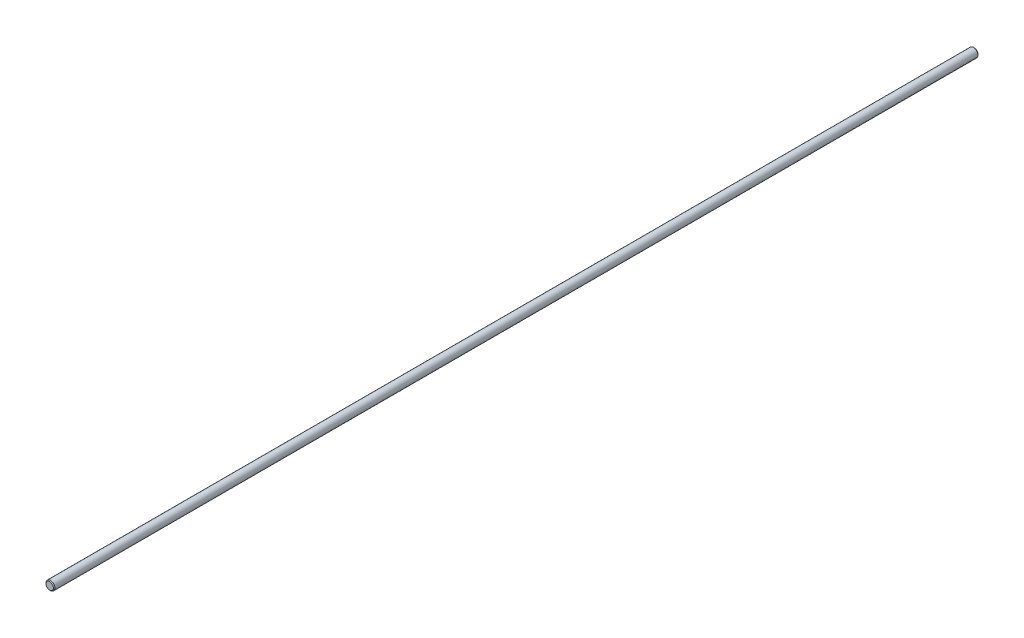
ISO-10303-21;
HEADER;
FILE_DESCRIPTION(('STEP AP214'),'2;1');
FILE_NAME('part.step','',(''),(''),'','','');
FILE_SCHEMA(('AUTOMOTIVE_DESIGN { 1 0 10303 214 1 1 1 1 }'));
ENDSEC;
DATA;
#1=APPLICATION_CONTEXT('core data for automotive mechanical design processes');
#2=APPLICATION_PROTOCOL_DEFINITION('international standard','automotive_design',2000,#1);
#3=PRODUCT_CONTEXT('',#1,'mechanical');
#4=PRODUCT('Part','Part','',(#3));
#5=PRODUCT_RELATED_PRODUCT_CATEGORY('part','',(#4));
#6=PRODUCT_DEFINITION_FORMATION('','',#4);
#7=PRODUCT_DEFINITION_CONTEXT('part definition',#1,'design');
#8=PRODUCT_DEFINITION('design','',#6,#7);
#9=PRODUCT_DEFINITION_SHAPE('','',#8);
#10=(LENGTH_UNIT() NAMED_UNIT(*) SI_UNIT(.MILLI.,.METRE.));
#11=(NAMED_UNIT(*) PLANE_ANGLE_UNIT() SI_UNIT($,.RADIAN.));
#12=(NAMED_UNIT(*) SI_UNIT($,.STERADIAN.) SOLID_ANGLE_UNIT());
#13=UNCERTAINTY_MEASURE_WITH_UNIT(LENGTH_MEASURE(1.E-05),#10,'distance_accuracy_value','');
#14=(GEOMETRIC_REPRESENTATION_CONTEXT(3) GLOBAL_UNCERTAINTY_ASSIGNED_CONTEXT((#13)) GLOBAL_UNIT_ASSIGNED_CONTEXT((#10,
#11,#12)) REPRESENTATION_CONTEXT('',''));
#15=CARTESIAN_POINT('',(0.,0.,0.));
#16=DIRECTION('',(0.,0.,1.));
#17=DIRECTION('',(1.,0.,0.));
#18=AXIS2_PLACEMENT_3D('',#15,#16,#17);
#19=CARTESIAN_POINT('',(0.,0.,990.6));
#20=DIRECTION('',(0.,0.,-1.));
#21=DIRECTION('',(-1.,0.,0.));
#22=AXIS2_PLACEMENT_3D('',#19,#20,#21);
#23=CYLINDRICAL_SURFACE('',#22,4.7625);
#24=CARTESIAN_POINT('',(0.,0.,0.793750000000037));
#25=DIRECTION('',(0.,0.,1.));
#26=DIRECTION('',(1.,0.,0.));
#27=AXIS2_PLACEMENT_3D('',#24,#25,#26);
#28=CIRCLE('',#27,4.7625);
#29=CARTESIAN_POINT('',(4.7625,0.,0.793750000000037));
#30=VERTEX_POINT('',#29);
#31=EDGE_CURVE('E40',#30,#30,#28,.T.);
#32=ORIENTED_EDGE('',*,*,#31,.T.);
#33=EDGE_LOOP('',(#32));
#34=FACE_BOUND('',#33,.T.);
#35=CARTESIAN_POINT('',(0.,0.,989.80625));
#36=DIRECTION('',(0.,0.,1.));
#37=DIRECTION('',(1.,0.,0.));
#38=AXIS2_PLACEMENT_3D('',#35,#36,#37);
#39=CIRCLE('',#38,4.7625);
#40=CARTESIAN_POINT('',(4.7625,0.,989.80625));
#41=VERTEX_POINT('',#40);
#42=EDGE_CURVE('E44',#41,#41,#39,.F.);
#43=ORIENTED_EDGE('',*,*,#42,.T.);
#44=EDGE_LOOP('',(#43));
#45=FACE_BOUND('',#44,.T.);
#46=ADVANCED_FACE('F29',(#34,#45),#23,.T.);
#47=CARTESIAN_POINT('',(0.,0.,990.6));
#48=DIRECTION('',(0.,0.,1.));
#49=DIRECTION('',(1.,0.,0.));
#50=AXIS2_PLACEMENT_3D('',#47,#48,#49);
#51=PLANE('',#50);
#52=CARTESIAN_POINT('',(0.,0.,990.6));
#53=DIRECTION('',(0.,0.,1.));
#54=DIRECTION('',(1.,0.,0.));
#55=AXIS2_PLACEMENT_3D('',#52,#53,#54);
#56=CIRCLE('',#55,3.96875000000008);
#57=CARTESIAN_POINT('',(3.96875000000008,0.,990.6));
#58=VERTEX_POINT('',#57);
#59=EDGE_CURVE('E10',#58,#58,#56,.T.);
#60=ORIENTED_EDGE('',*,*,#59,.T.);
#61=EDGE_LOOP('',(#60));
#62=FACE_BOUND('',#61,.T.);
#63=ADVANCED_FACE('F60',(#62),#51,.T.);
#64=CARTESIAN_POINT('',(0.,0.,0.));
#65=DIRECTION('',(0.,0.,1.));
#66=DIRECTION('',(1.,0.,0.));
#67=AXIS2_PLACEMENT_3D('',#64,#65,#66);
#68=PLANE('',#67);
#69=CARTESIAN_POINT('',(0.,0.,0.));
#70=DIRECTION('',(0.,0.,1.));
#71=DIRECTION('',(1.,0.,0.));
#72=AXIS2_PLACEMENT_3D('',#69,#70,#71);
#73=CIRCLE('',#72,3.96875000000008);
#74=CARTESIAN_POINT('',(3.96875000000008,0.,0.));
#75=VERTEX_POINT('',#74);
#76=EDGE_CURVE('E36',#75,#75,#73,.F.);
#77=ORIENTED_EDGE('',*,*,#76,.T.);
#78=EDGE_LOOP('',(#77));
#79=FACE_BOUND('',#78,.T.);
#80=ADVANCED_FACE('F57',(#79),#68,.F.);
#81=CARTESIAN_POINT('',(0.,0.,0.793750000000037));
#82=DIRECTION('',(0.,0.,1.));
#83=DIRECTION('',(1.,0.,0.));
#84=AXIS2_PLACEMENT_3D('',#81,#82,#83);
#85=CONICAL_SURFACE('',#84,4.7625,0.785398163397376);
#86=ORIENTED_EDGE('',*,*,#76,.F.);
#87=EDGE_LOOP('',(#86));
#88=FACE_BOUND('',#87,.T.);
#89=ORIENTED_EDGE('',*,*,#31,.F.);
#90=EDGE_LOOP('',(#89));
#91=FACE_BOUND('',#90,.T.);
#92=ADVANCED_FACE('F53',(#88,#91),#85,.T.);
#93=CARTESIAN_POINT('',(0.,0.,990.6));
#94=DIRECTION('',(0.,0.,-1.));
#95=DIRECTION('',(-1.,0.,0.));
#96=AXIS2_PLACEMENT_3D('',#93,#94,#95);
#97=CONICAL_SURFACE('',#96,3.96875000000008,0.785398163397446);
#98=ORIENTED_EDGE('',*,*,#42,.F.);
#99=EDGE_LOOP('',(#98));
#100=FACE_BOUND('',#99,.T.);
#101=ORIENTED_EDGE('',*,*,#59,.F.);
#102=EDGE_LOOP('',(#101));
#103=FACE_BOUND('',#102,.T.);
#104=ADVANCED_FACE('F31',(#100,#103),#97,.T.);
#105=CLOSED_SHELL('',(#46,#63,#80,#92,#104));
#106=MANIFOLD_SOLID_BREP('B2',#105);
#107=ADVANCED_BREP_SHAPE_REPRESENTATION('',(#18,#106),#14);
#108=SHAPE_DEFINITION_REPRESENTATION(#9,#107);
ENDSEC;
END-ISO-10303-21;
